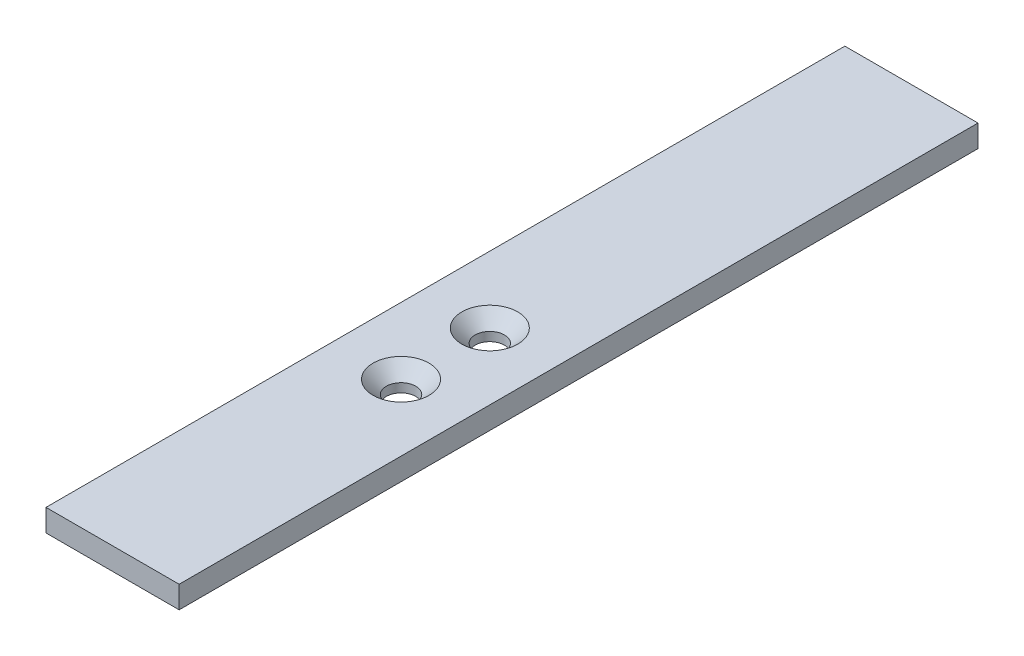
ISO-10303-21;
HEADER;
FILE_DESCRIPTION(('STEP AP214'),'2;1');
FILE_NAME('part.step','',(''),(''),'','','');
FILE_SCHEMA(('AUTOMOTIVE_DESIGN { 1 0 10303 214 1 1 1 1 }'));
ENDSEC;
DATA;
#1=APPLICATION_CONTEXT('core data for automotive mechanical design processes');
#2=APPLICATION_PROTOCOL_DEFINITION('international standard','automotive_design',2000,#1);
#3=PRODUCT_CONTEXT('',#1,'mechanical');
#4=PRODUCT('Part','Part','',(#3));
#5=PRODUCT_RELATED_PRODUCT_CATEGORY('part','',(#4));
#6=PRODUCT_DEFINITION_FORMATION('','',#4);
#7=PRODUCT_DEFINITION_CONTEXT('part definition',#1,'design');
#8=PRODUCT_DEFINITION('design','',#6,#7);
#9=PRODUCT_DEFINITION_SHAPE('','',#8);
#10=(LENGTH_UNIT() NAMED_UNIT(*) SI_UNIT(.MILLI.,.METRE.));
#11=(NAMED_UNIT(*) PLANE_ANGLE_UNIT() SI_UNIT($,.RADIAN.));
#12=(NAMED_UNIT(*) SI_UNIT($,.STERADIAN.) SOLID_ANGLE_UNIT());
#13=UNCERTAINTY_MEASURE_WITH_UNIT(LENGTH_MEASURE(1.E-05),#10,'distance_accuracy_value','');
#14=(GEOMETRIC_REPRESENTATION_CONTEXT(3) GLOBAL_UNCERTAINTY_ASSIGNED_CONTEXT((#13)) GLOBAL_UNIT_ASSIGNED_CONTEXT((#10,
#11,#12)) REPRESENTATION_CONTEXT('',''));
#15=CARTESIAN_POINT('',(0.,0.,0.));
#16=DIRECTION('',(0.,0.,1.));
#17=DIRECTION('',(1.,0.,0.));
#18=AXIS2_PLACEMENT_3D('',#15,#16,#17);
#19=CARTESIAN_POINT('',(-15.,2.5,180.));
#20=DIRECTION('',(1.00000000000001,0.,0.));
#21=DIRECTION('',(0.,0.,-1.00000000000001));
#22=AXIS2_PLACEMENT_3D('',#19,#20,#21);
#23=PLANE('',#22);
#24=DIRECTION('',(0.,-1.,0.));
#25=VECTOR('',#24,1.);
#26=CARTESIAN_POINT('',(-15.,2.5,0.));
#27=LINE('',#26,#25);
#28=CARTESIAN_POINT('',(-15.,2.5,0.));
#29=VERTEX_POINT('',#28);
#30=CARTESIAN_POINT('',(-15.,-2.5,0.));
#31=VERTEX_POINT('',#30);
#32=EDGE_CURVE('E83',#29,#31,#27,.T.);
#33=ORIENTED_EDGE('',*,*,#32,.T.);
#34=DIRECTION('',(0.,0.,-1.00000000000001));
#35=VECTOR('',#34,1.);
#36=CARTESIAN_POINT('',(-15.,-2.5,180.));
#37=LINE('',#36,#35);
#38=CARTESIAN_POINT('',(-15.,-2.5,180.));
#39=VERTEX_POINT('',#38);
#40=EDGE_CURVE('E11',#39,#31,#37,.T.);
#41=ORIENTED_EDGE('',*,*,#40,.F.);
#42=DIRECTION('',(0.,-1.,0.));
#43=VECTOR('',#42,1.);
#44=CARTESIAN_POINT('',(-15.,2.5,180.));
#45=LINE('',#44,#43);
#46=CARTESIAN_POINT('',(-15.,2.5,180.));
#47=VERTEX_POINT('',#46);
#48=EDGE_CURVE('E112',#47,#39,#45,.T.);
#49=ORIENTED_EDGE('',*,*,#48,.F.);
#50=DIRECTION('',(0.,0.,-1.00000000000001));
#51=VECTOR('',#50,1.);
#52=CARTESIAN_POINT('',(-15.,2.5,180.));
#53=LINE('',#52,#51);
#54=EDGE_CURVE('E96',#47,#29,#53,.T.);
#55=ORIENTED_EDGE('',*,*,#54,.T.);
#56=EDGE_LOOP('',(#33,#41,#49,#55));
#57=FACE_BOUND('',#56,.T.);
#58=ADVANCED_FACE('F36',(#57),#23,.F.);
#59=CARTESIAN_POINT('',(-15.,-2.5,180.));
#60=DIRECTION('',(0.,1.,0.));
#61=DIRECTION('',(-1.00000000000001,0.,0.));
#62=AXIS2_PLACEMENT_3D('',#59,#60,#61);
#63=PLANE('',#62);
#64=CARTESIAN_POINT('',(9.43689570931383E-13,-2.5,115.));
#65=DIRECTION('',(0.,1.,0.));
#66=DIRECTION('',(-1.00000000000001,0.,0.));
#67=AXIS2_PLACEMENT_3D('',#64,#65,#66);
#68=CIRCLE('',#67,3.3);
#69=CARTESIAN_POINT('',(-3.29999999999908,-2.5,115.));
#70=VERTEX_POINT('',#69);
#71=EDGE_CURVE('E39',#70,#70,#68,.T.);
#72=ORIENTED_EDGE('',*,*,#71,.T.);
#73=EDGE_LOOP('',(#72));
#74=FACE_BOUND('',#73,.T.);
#75=CARTESIAN_POINT('',(-1.66533453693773E-13,-2.5,95.0000000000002));
#76=DIRECTION('',(0.,1.,0.));
#77=DIRECTION('',(-1.00000000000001,0.,0.));
#78=AXIS2_PLACEMENT_3D('',#75,#76,#77);
#79=CIRCLE('',#78,3.3);
#80=CARTESIAN_POINT('',(-3.30000000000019,-2.5,95.0000000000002));
#81=VERTEX_POINT('',#80);
#82=EDGE_CURVE('E98',#81,#81,#79,.T.);
#83=ORIENTED_EDGE('',*,*,#82,.T.);
#84=EDGE_LOOP('',(#83));
#85=FACE_BOUND('',#84,.T.);
#86=DIRECTION('',(1.00000000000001,0.,0.));
#87=VECTOR('',#86,1.);
#88=CARTESIAN_POINT('',(-15.,-2.5,0.));
#89=LINE('',#88,#87);
#90=CARTESIAN_POINT('',(15.,-2.5,0.));
#91=VERTEX_POINT('',#90);
#92=EDGE_CURVE('E79',#31,#91,#89,.T.);
#93=ORIENTED_EDGE('',*,*,#92,.T.);
#94=DIRECTION('',(0.,0.,-1.00000000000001));
#95=VECTOR('',#94,1.);
#96=CARTESIAN_POINT('',(15.,-2.5,180.000000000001));
#97=LINE('',#96,#95);
#98=CARTESIAN_POINT('',(15.,-2.5,180.000000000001));
#99=VERTEX_POINT('',#98);
#100=EDGE_CURVE('E45',#99,#91,#97,.T.);
#101=ORIENTED_EDGE('',*,*,#100,.F.);
#102=DIRECTION('',(1.00000000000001,0.,0.));
#103=VECTOR('',#102,1.);
#104=CARTESIAN_POINT('',(-15.,-2.5,180.));
#105=LINE('',#104,#103);
#106=EDGE_CURVE('E92',#39,#99,#105,.T.);
#107=ORIENTED_EDGE('',*,*,#106,.F.);
#108=ORIENTED_EDGE('',*,*,#40,.T.);
#109=EDGE_LOOP('',(#93,#101,#107,#108));
#110=FACE_BOUND('',#109,.T.);
#111=ADVANCED_FACE('F91',(#74,#85,#110),#63,.F.);
#112=CARTESIAN_POINT('',(15.,2.5,180.000000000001));
#113=DIRECTION('',(-1.00000000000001,0.,0.));
#114=DIRECTION('',(0.,0.,1.00000000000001));
#115=AXIS2_PLACEMENT_3D('',#112,#113,#114);
#116=PLANE('',#115);
#117=DIRECTION('',(0.,1.,0.));
#118=VECTOR('',#117,1.);
#119=CARTESIAN_POINT('',(15.,2.5,0.));
#120=LINE('',#119,#118);
#121=CARTESIAN_POINT('',(15.,2.5,0.));
#122=VERTEX_POINT('',#121);
#123=EDGE_CURVE('E84',#91,#122,#120,.T.);
#124=ORIENTED_EDGE('',*,*,#123,.T.);
#125=DIRECTION('',(0.,0.,-1.00000000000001));
#126=VECTOR('',#125,1.);
#127=CARTESIAN_POINT('',(15.,2.5,180.000000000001));
#128=LINE('',#127,#126);
#129=CARTESIAN_POINT('',(15.,2.5,180.000000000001));
#130=VERTEX_POINT('',#129);
#131=EDGE_CURVE('E123',#130,#122,#128,.T.);
#132=ORIENTED_EDGE('',*,*,#131,.F.);
#133=DIRECTION('',(0.,1.,0.));
#134=VECTOR('',#133,1.);
#135=CARTESIAN_POINT('',(15.,2.5,180.000000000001));
#136=LINE('',#135,#134);
#137=EDGE_CURVE('E58',#99,#130,#136,.T.);
#138=ORIENTED_EDGE('',*,*,#137,.F.);
#139=ORIENTED_EDGE('',*,*,#100,.T.);
#140=EDGE_LOOP('',(#124,#132,#138,#139));
#141=FACE_BOUND('',#140,.T.);
#142=ADVANCED_FACE('F130',(#141),#116,.F.);
#143=CARTESIAN_POINT('',(-15.,2.5,180.));
#144=DIRECTION('',(0.,-1.,0.));
#145=DIRECTION('',(1.00000000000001,0.,0.));
#146=AXIS2_PLACEMENT_3D('',#143,#144,#145);
#147=PLANE('',#146);
#148=CARTESIAN_POINT('',(9.43689570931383E-13,2.5,115.));
#149=DIRECTION('',(0.,1.,0.));
#150=DIRECTION('',(0.,0.,1.00000000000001));
#151=AXIS2_PLACEMENT_3D('',#148,#149,#150);
#152=CIRCLE('',#151,6.3);
#153=CARTESIAN_POINT('',(9.43689570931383E-13,2.5,121.3));
#154=VERTEX_POINT('',#153);
#155=EDGE_CURVE('E184',#154,#154,#152,.T.);
#156=ORIENTED_EDGE('',*,*,#155,.F.);
#157=EDGE_LOOP('',(#156));
#158=FACE_BOUND('',#157,.T.);
#159=CARTESIAN_POINT('',(-1.66533453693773E-13,2.5,95.));
#160=DIRECTION('',(0.,1.,0.));
#161=DIRECTION('',(0.,0.,1.00000000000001));
#162=AXIS2_PLACEMENT_3D('',#159,#160,#161);
#163=CIRCLE('',#162,6.3);
#164=CARTESIAN_POINT('',(-1.66533453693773E-13,2.5,101.3));
#165=VERTEX_POINT('',#164);
#166=EDGE_CURVE('E104',#165,#165,#163,.T.);
#167=ORIENTED_EDGE('',*,*,#166,.F.);
#168=EDGE_LOOP('',(#167));
#169=FACE_BOUND('',#168,.T.);
#170=DIRECTION('',(-1.00000000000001,0.,0.));
#171=VECTOR('',#170,1.);
#172=CARTESIAN_POINT('',(-15.,2.5,0.));
#173=LINE('',#172,#171);
#174=EDGE_CURVE('E109',#122,#29,#173,.T.);
#175=ORIENTED_EDGE('',*,*,#174,.T.);
#176=ORIENTED_EDGE('',*,*,#54,.F.);
#177=DIRECTION('',(-1.00000000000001,0.,0.));
#178=VECTOR('',#177,1.);
#179=CARTESIAN_POINT('',(-15.,2.5,180.));
#180=LINE('',#179,#178);
#181=EDGE_CURVE('E53',#130,#47,#180,.T.);
#182=ORIENTED_EDGE('',*,*,#181,.F.);
#183=ORIENTED_EDGE('',*,*,#131,.T.);
#184=EDGE_LOOP('',(#175,#176,#182,#183));
#185=FACE_BOUND('',#184,.T.);
#186=ADVANCED_FACE('F132',(#158,#169,#185),#147,.F.);
#187=CARTESIAN_POINT('',(-15.,-2.5,180.));
#188=DIRECTION('',(0.,0.,1.00000000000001));
#189=DIRECTION('',(1.00000000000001,0.,0.));
#190=AXIS2_PLACEMENT_3D('',#187,#188,#189);
#191=PLANE('',#190);
#192=ORIENTED_EDGE('',*,*,#48,.T.);
#193=ORIENTED_EDGE('',*,*,#106,.T.);
#194=ORIENTED_EDGE('',*,*,#137,.T.);
#195=ORIENTED_EDGE('',*,*,#181,.T.);
#196=EDGE_LOOP('',(#192,#193,#194,#195));
#197=FACE_BOUND('',#196,.T.);
#198=ADVANCED_FACE('F133',(#197),#191,.T.);
#199=CARTESIAN_POINT('',(-15.,-2.5,0.));
#200=DIRECTION('',(0.,0.,1.00000000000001));
#201=DIRECTION('',(1.00000000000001,0.,0.));
#202=AXIS2_PLACEMENT_3D('',#199,#200,#201);
#203=PLANE('',#202);
#204=ORIENTED_EDGE('',*,*,#32,.F.);
#205=ORIENTED_EDGE('',*,*,#174,.F.);
#206=ORIENTED_EDGE('',*,*,#123,.F.);
#207=ORIENTED_EDGE('',*,*,#92,.F.);
#208=EDGE_LOOP('',(#204,#205,#206,#207));
#209=FACE_BOUND('',#208,.T.);
#210=ADVANCED_FACE('F80',(#209),#203,.F.);
#211=CARTESIAN_POINT('',(-1.66533453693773E-13,2.5,95.));
#212=DIRECTION('',(0.,1.,0.));
#213=DIRECTION('',(0.,0.,1.00000000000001));
#214=AXIS2_PLACEMENT_3D('',#211,#212,#213);
#215=CYLINDRICAL_SURFACE('',#214,3.3);
#216=CARTESIAN_POINT('',(-1.66533453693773E-13,-0.5,95.0000000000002));
#217=DIRECTION('',(0.,1.,0.));
#218=DIRECTION('',(0.,0.,1.00000000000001));
#219=AXIS2_PLACEMENT_3D('',#216,#217,#218);
#220=CIRCLE('',#219,3.3);
#221=CARTESIAN_POINT('',(-1.66533453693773E-13,-0.5,98.3000000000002));
#222=VERTEX_POINT('',#221);
#223=EDGE_CURVE('E183',#222,#222,#220,.T.);
#224=ORIENTED_EDGE('',*,*,#223,.T.);
#225=EDGE_LOOP('',(#224));
#226=FACE_BOUND('',#225,.T.);
#227=ORIENTED_EDGE('',*,*,#82,.F.);
#228=EDGE_LOOP('',(#227));
#229=FACE_BOUND('',#228,.T.);
#230=ADVANCED_FACE('F140',(#226,#229),#215,.F.);
#231=CARTESIAN_POINT('',(-1.66533453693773E-13,2.5,95.));
#232=DIRECTION('',(0.,1.,0.));
#233=DIRECTION('',(0.,0.,1.00000000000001));
#234=AXIS2_PLACEMENT_3D('',#231,#232,#233);
#235=CONICAL_SURFACE('',#234,6.3,0.785398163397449);
#236=ORIENTED_EDGE('',*,*,#223,.F.);
#237=EDGE_LOOP('',(#236));
#238=FACE_BOUND('',#237,.T.);
#239=ORIENTED_EDGE('',*,*,#166,.T.);
#240=EDGE_LOOP('',(#239));
#241=FACE_BOUND('',#240,.T.);
#242=ADVANCED_FACE('F159',(#238,#241),#235,.F.);
#243=CARTESIAN_POINT('',(9.43689570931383E-13,2.5,115.));
#244=DIRECTION('',(0.,1.,0.));
#245=DIRECTION('',(0.,0.,1.00000000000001));
#246=AXIS2_PLACEMENT_3D('',#243,#244,#245);
#247=CYLINDRICAL_SURFACE('',#246,3.3);
#248=CARTESIAN_POINT('',(9.43689570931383E-13,-0.5,115.));
#249=DIRECTION('',(0.,1.,0.));
#250=DIRECTION('',(0.,0.,1.00000000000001));
#251=AXIS2_PLACEMENT_3D('',#248,#249,#250);
#252=CIRCLE('',#251,3.3);
#253=CARTESIAN_POINT('',(9.43689570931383E-13,-0.5,118.3));
#254=VERTEX_POINT('',#253);
#255=EDGE_CURVE('E181',#254,#254,#252,.T.);
#256=ORIENTED_EDGE('',*,*,#255,.T.);
#257=EDGE_LOOP('',(#256));
#258=FACE_BOUND('',#257,.T.);
#259=ORIENTED_EDGE('',*,*,#71,.F.);
#260=EDGE_LOOP('',(#259));
#261=FACE_BOUND('',#260,.T.);
#262=ADVANCED_FACE('F165',(#258,#261),#247,.F.);
#263=CARTESIAN_POINT('',(9.43689570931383E-13,2.5,115.));
#264=DIRECTION('',(0.,1.,0.));
#265=DIRECTION('',(0.,0.,1.00000000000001));
#266=AXIS2_PLACEMENT_3D('',#263,#264,#265);
#267=CONICAL_SURFACE('',#266,6.3,0.785398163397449);
#268=ORIENTED_EDGE('',*,*,#255,.F.);
#269=EDGE_LOOP('',(#268));
#270=FACE_BOUND('',#269,.T.);
#271=ORIENTED_EDGE('',*,*,#155,.T.);
#272=EDGE_LOOP('',(#271));
#273=FACE_BOUND('',#272,.T.);
#274=ADVANCED_FACE('F170',(#270,#273),#267,.F.);
#275=CLOSED_SHELL('',(#58,#111,#142,#186,#198,#210,#230,#242,#262,#274));
#276=MANIFOLD_SOLID_BREP('B2',#275);
#277=ADVANCED_BREP_SHAPE_REPRESENTATION('',(#18,#276),#14);
#278=SHAPE_DEFINITION_REPRESENTATION(#9,#277);
ENDSEC;
END-ISO-10303-21;
